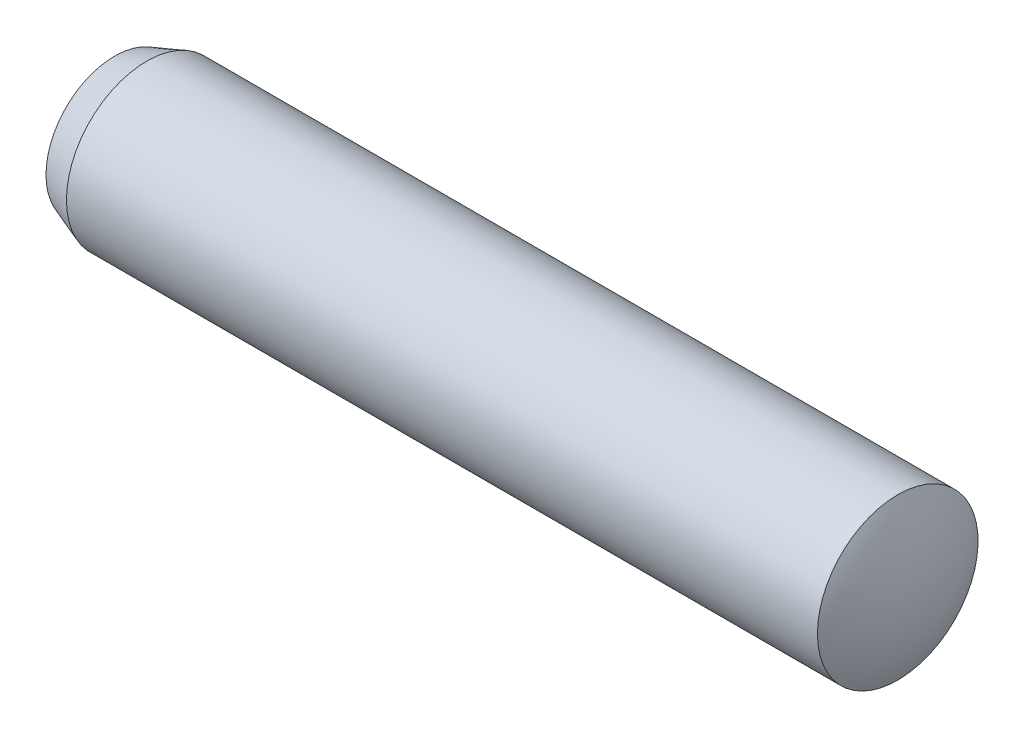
ISO-10303-21;
HEADER;
FILE_DESCRIPTION(('STEP AP214'),'2;1');
FILE_NAME('part.step','',(''),(''),'','','');
FILE_SCHEMA(('AUTOMOTIVE_DESIGN { 1 0 10303 214 1 1 1 1 }'));
ENDSEC;
DATA;
#1=APPLICATION_CONTEXT('core data for automotive mechanical design processes');
#2=APPLICATION_PROTOCOL_DEFINITION('international standard','automotive_design',2000,#1);
#3=PRODUCT_CONTEXT('',#1,'mechanical');
#4=PRODUCT('Part','Part','',(#3));
#5=PRODUCT_RELATED_PRODUCT_CATEGORY('part','',(#4));
#6=PRODUCT_DEFINITION_FORMATION('','',#4);
#7=PRODUCT_DEFINITION_CONTEXT('part definition',#1,'design');
#8=PRODUCT_DEFINITION('design','',#6,#7);
#9=PRODUCT_DEFINITION_SHAPE('','',#8);
#10=(LENGTH_UNIT() NAMED_UNIT(*) SI_UNIT(.MILLI.,.METRE.));
#11=(NAMED_UNIT(*) PLANE_ANGLE_UNIT() SI_UNIT($,.RADIAN.));
#12=(NAMED_UNIT(*) SI_UNIT($,.STERADIAN.) SOLID_ANGLE_UNIT());
#13=UNCERTAINTY_MEASURE_WITH_UNIT(LENGTH_MEASURE(1.E-05),#10,'distance_accuracy_value','');
#14=(GEOMETRIC_REPRESENTATION_CONTEXT(3) GLOBAL_UNCERTAINTY_ASSIGNED_CONTEXT((#13)) GLOBAL_UNIT_ASSIGNED_CONTEXT((#10,
#11,#12)) REPRESENTATION_CONTEXT('',''));
#15=CARTESIAN_POINT('',(0.,0.,0.));
#16=DIRECTION('',(0.,0.,1.));
#17=DIRECTION('',(1.,0.,0.));
#18=AXIS2_PLACEMENT_3D('',#15,#16,#17);
#19=CARTESIAN_POINT('',(0.,3.60822483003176E-13,-4.85722573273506E-13));
#20=DIRECTION('',(-1.,0.,0.));
#21=DIRECTION('',(0.,0.,1.00000000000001));
#22=AXIS2_PLACEMENT_3D('',#19,#20,#21);
#23=PLANE('',#22);
#24=CARTESIAN_POINT('',(0.,3.60822483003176E-13,-4.85722573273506E-13));
#25=DIRECTION('',(-1.,0.,0.));
#26=DIRECTION('',(0.,0.,1.00000000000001));
#27=AXIS2_PLACEMENT_3D('',#24,#25,#26);
#28=CIRCLE('',#27,3.41764762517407);
#29=CARTESIAN_POINT('',(0.,3.70213501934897E-13,3.41764762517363));
#30=VERTEX_POINT('',#29);
#31=EDGE_CURVE('E10',#30,#30,#28,.T.);
#32=ORIENTED_EDGE('',*,*,#31,.T.);
#33=EDGE_LOOP('',(#32));
#34=FACE_BOUND('',#33,.T.);
#35=ADVANCED_FACE('F27',(#34),#23,.T.);
#36=CARTESIAN_POINT('',(0.,3.60822483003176E-13,-4.85722573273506E-13));
#37=DIRECTION('',(1.,0.,0.));
#38=DIRECTION('',(0.,0.,-1.00000000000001));
#39=AXIS2_PLACEMENT_3D('',#36,#37,#38);
#40=CONICAL_SURFACE('',#39,3.41764762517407,0.349065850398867);
#41=CARTESIAN_POINT('',(1.59999999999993,1.11022302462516E-13,-4.30211422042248E-13));
#42=DIRECTION('',(-1.,0.,0.));
#43=DIRECTION('',(0.,0.,1.00000000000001));
#44=AXIS2_PLACEMENT_3D('',#41,#42,#43);
#45=CIRCLE('',#44,4.);
#46=CARTESIAN_POINT('',(1.59999999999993,1.22013510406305E-13,3.99999999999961));
#47=VERTEX_POINT('',#46);
#48=EDGE_CURVE('E33',#47,#47,#45,.T.);
#49=ORIENTED_EDGE('',*,*,#48,.T.);
#50=EDGE_LOOP('',(#49));
#51=FACE_BOUND('',#50,.T.);
#52=ORIENTED_EDGE('',*,*,#31,.F.);
#53=EDGE_LOOP('',(#52));
#54=FACE_BOUND('',#53,.T.);
#55=ADVANCED_FACE('F53',(#51,#54),#40,.T.);
#56=CARTESIAN_POINT('',(0.,3.60822483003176E-13,-4.85722573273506E-13));
#57=DIRECTION('',(-1.,0.,0.));
#58=DIRECTION('',(0.,0.,1.00000000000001));
#59=AXIS2_PLACEMENT_3D('',#56,#57,#58);
#60=CYLINDRICAL_SURFACE('',#59,4.);
#61=CARTESIAN_POINT('',(38.9999999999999,1.66533453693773E-13,-5.96744875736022E-13));
#62=DIRECTION('',(-1.,0.,0.));
#63=DIRECTION('',(0.,0.,1.00000000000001));
#64=AXIS2_PLACEMENT_3D('',#61,#62,#63);
#65=CIRCLE('',#64,4.);
#66=CARTESIAN_POINT('',(38.9999999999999,1.77524661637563E-13,3.99999999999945));
#67=VERTEX_POINT('',#66);
#68=EDGE_CURVE('E37',#67,#67,#65,.T.);
#69=ORIENTED_EDGE('',*,*,#68,.T.);
#70=EDGE_LOOP('',(#69));
#71=FACE_BOUND('',#70,.T.);
#72=ORIENTED_EDGE('',*,*,#48,.F.);
#73=EDGE_LOOP('',(#72));
#74=FACE_BOUND('',#73,.T.);
#75=ADVANCED_FACE('F44',(#71,#74),#60,.T.);
#76=CARTESIAN_POINT('',(31.4999999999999,2.4980018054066E-13,-4.44089209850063E-13));
#77=DIRECTION('',(-1.,0.,0.));
#78=DIRECTION('',(0.,1.00000000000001,0.));
#79=AXIS2_PLACEMENT_3D('',#76,#77,#78);
#80=SPHERICAL_SURFACE('',#79,8.49999999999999);
#81=ORIENTED_EDGE('',*,*,#68,.F.);
#82=EDGE_LOOP('',(#81));
#83=FACE_BOUND('',#82,.T.);
#84=ADVANCED_FACE('F47',(#83),#80,.T.);
#85=CLOSED_SHELL('',(#35,#55,#75,#84));
#86=MANIFOLD_SOLID_BREP('B2',#85);
#87=ADVANCED_BREP_SHAPE_REPRESENTATION('',(#18,#86),#14);
#88=SHAPE_DEFINITION_REPRESENTATION(#9,#87);
ENDSEC;
END-ISO-10303-21;
